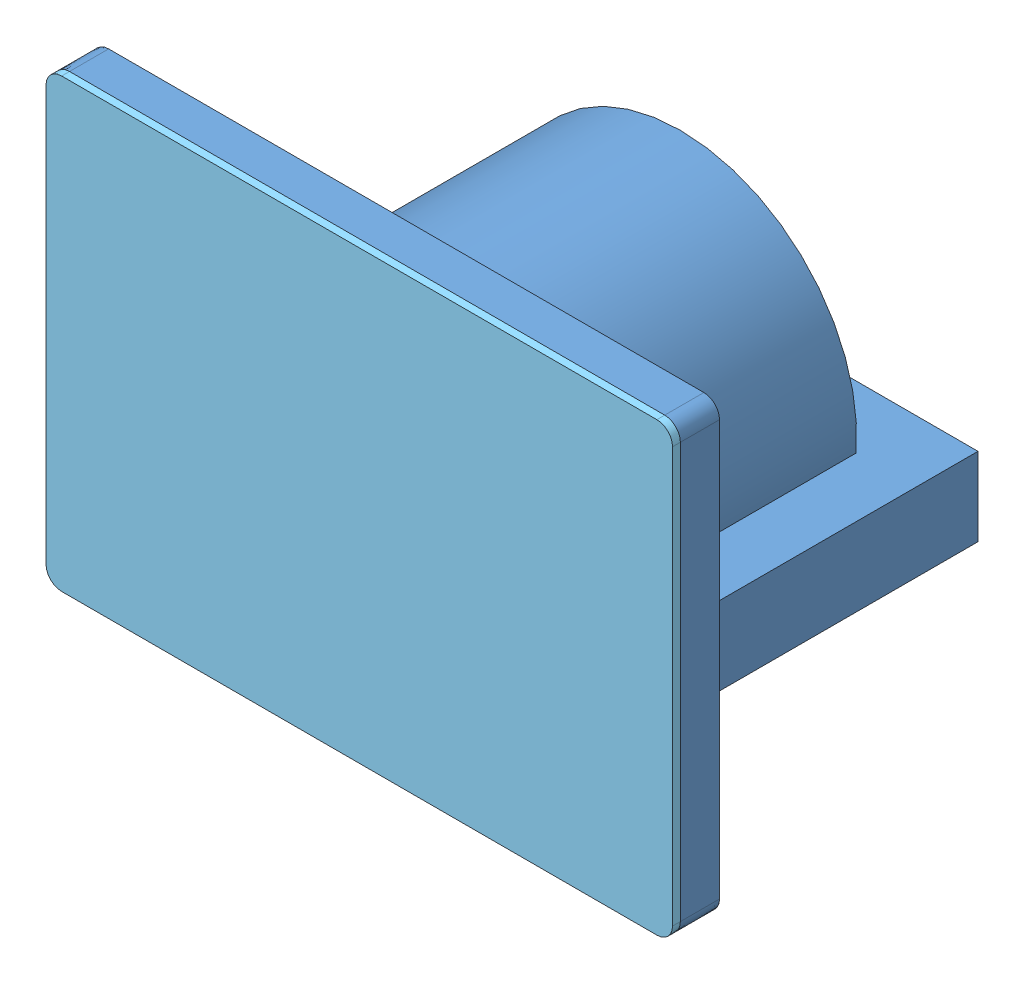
SolidWorks assembly VOLTMETRE.SLDASM, configuration Défaut (file format 7000). Lengths in mm.
Overall size (80 57 49).
6 component instances, 5 part files, 13 mates.
Components (placement in the parent):
- volt1-1: volt1.SLDPRT [Défaut] at (35.2566 -28.9498 99) size (80 57 48)
- volt2-1: volt2.SLDPRT [Défaut] at (-41.7434 -25.9498 100) size (74 51 1.5)
- AIGUILLE-1: AIGUILLE.SLDPRT [Défaut] at (-4.7434 -18.9498 102) x (-0.907232 0.420631 0) z (0 0 -1) size (8 44 2)
- VisV-1: VisV.SLDPRT [Défaut] at (2.7566 0.0502 60.5) x (0 1 0) z (0.119872 0 0.992789) size (4.85 4 4)
- VisV-2: VisV.SLDPRT [Défaut] at (-12.2434 0.0502 60.5) x (0 1 0) z (0.646479 0 0.762932) size (4.85 4 4)
- Verre-1: Verre.SLDPRT [Défaut] at (-41.7434 -25.9498 103) size (80 57 2)
Mates (geometry in assembly coordinates):
- Coïncidente4: coincident anti-aligned: plane of volt1-1 through (35.2566 -28.9498 100) normal (0 0 1); plane of volt2-1 through (-41.7434 -25.9498 100) normal (0 0 -1)
- Coïncidente5: coincident anti-aligned: plane of volt1-1 through (32.2566 25.0502 100) normal (-1 0 0); plane of volt2-1 through (32.2566 -25.9498 101) normal (1 0 0)
- Coïncidente6: coincident anti-aligned: plane of volt1-1 through (35.2566 -28.9498 100) normal (0 0 1); plane of volt2-1 through (-41.7434 -25.9498 100) normal (0 0 -1)
- Coïncidente7: coincident anti-aligned: plane of volt1-1 through (-41.7434 25.0502 100) normal (0 -1 0); plane of volt2-1 through (-41.7434 25.0502 101) normal (0 1 0)
- Coïncidente8: coincident anti-aligned: plane of volt2-1 through (-41.7434 -25.9498 101) normal (0 0 1); plane of AIGUILLE-1 through (-4.7434 -18.9498 101) normal (0 0 -1)
- Coaxiale1: concentric aligned: cylinder of volt2-1 through (-4.7434 -18.9498 100) axis (0 0 1) radius 1; cylinder of AIGUILLE-1 through (-4.7434 -18.9498 100) axis (0 0 1) radius 1
- Coaxiale2: concentric anti-aligned: cylinder of volt1-1 through (2.7566 -1.9498 60.5) axis (0 1 0) radius 1; cylinder of VisV-1 through (2.7566 -3.9134 60.5) axis (0 -1 0) radius 1
- Coaxiale3: concentric anti-aligned: cylinder of volt1-1 through (-12.2434 -1.9498 60.5) axis (0 1 0) radius 1; cylinder of VisV-2 through (-12.2434 -3.9134 60.5) axis (0 -1 0) radius 1
- Coïncidente9: coincident anti-aligned: plane of volt1-1 through (5.2566 1.0502 58) normal (0 1 0); plane of VisV-1 through (1.7638 1.0502 60.6199) normal (0 -1 0)
- Coïncidente10: coincident anti-aligned: plane of volt1-1 through (-9.7434 1.0502 58) normal (0 1 0); plane of VisV-2 through (-13.0063 1.0502 61.1465) normal (0 -1 0)
- Coïncidente11: coincident anti-aligned: plane of volt1-1 through (35.2566 -28.9498 104) normal (0 0 1); plane of Verre-1 through (-4.7434 -0.4498 104) normal (0 0 -1)
- Coïncidente12: coincident aligned: plane of volt1-1 through (-44.7434 28.0502 104) normal (0 1 0); plane of Verre-1 through (-44.7434 28.0502 105) normal (0 1 0)
- Coïncidente13: coincident aligned: plane of volt1-1 through (35.2566 28.0502 104) normal (1 0 0); plane of Verre-1 through (35.2566 -28.9498 105) normal (1 0 0)
